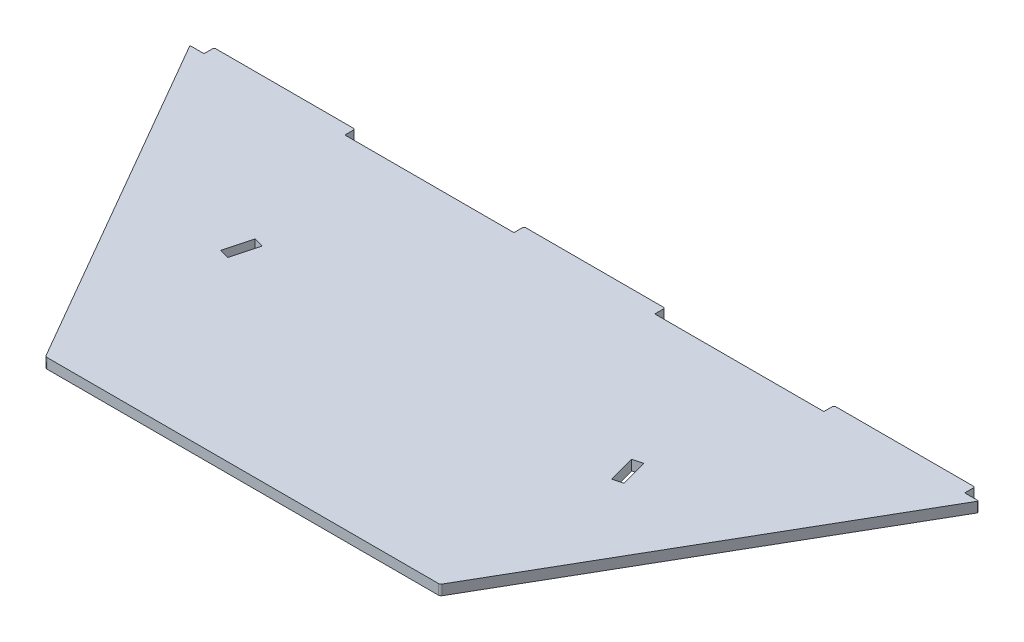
ISO-10303-21;
HEADER;
FILE_DESCRIPTION(('STEP AP214'),'2;1');
FILE_NAME('part.step','',(''),(''),'','','');
FILE_SCHEMA(('AUTOMOTIVE_DESIGN { 1 0 10303 214 1 1 1 1 }'));
ENDSEC;
DATA;
#1=APPLICATION_CONTEXT('core data for automotive mechanical design processes');
#2=APPLICATION_PROTOCOL_DEFINITION('international standard','automotive_design',2000,#1);
#3=PRODUCT_CONTEXT('',#1,'mechanical');
#4=PRODUCT('Part','Part','',(#3));
#5=PRODUCT_RELATED_PRODUCT_CATEGORY('part','',(#4));
#6=PRODUCT_DEFINITION_FORMATION('','',#4);
#7=PRODUCT_DEFINITION_CONTEXT('part definition',#1,'design');
#8=PRODUCT_DEFINITION('design','',#6,#7);
#9=PRODUCT_DEFINITION_SHAPE('','',#8);
#10=(LENGTH_UNIT() NAMED_UNIT(*) SI_UNIT(.MILLI.,.METRE.));
#11=(NAMED_UNIT(*) PLANE_ANGLE_UNIT() SI_UNIT($,.RADIAN.));
#12=(NAMED_UNIT(*) SI_UNIT($,.STERADIAN.) SOLID_ANGLE_UNIT());
#13=UNCERTAINTY_MEASURE_WITH_UNIT(LENGTH_MEASURE(1.E-05),#10,'distance_accuracy_value','');
#14=(GEOMETRIC_REPRESENTATION_CONTEXT(3) GLOBAL_UNCERTAINTY_ASSIGNED_CONTEXT((#13)) GLOBAL_UNIT_ASSIGNED_CONTEXT((#10,
#11,#12)) REPRESENTATION_CONTEXT('',''));
#15=CARTESIAN_POINT('',(0.,0.,0.));
#16=DIRECTION('',(0.,0.,1.));
#17=DIRECTION('',(1.,0.,0.));
#18=AXIS2_PLACEMENT_3D('',#15,#16,#17);
#19=CARTESIAN_POINT('',(-700.,0.,0.));
#20=DIRECTION('',(0.,0.,1.));
#21=DIRECTION('',(1.,0.,0.));
#22=AXIS2_PLACEMENT_3D('',#19,#20,#21);
#23=PLANE('',#22);
#24=DIRECTION('',(1.,0.,0.));
#25=VECTOR('',#24,1.);
#26=CARTESIAN_POINT('',(-700.,18.,0.));
#27=LINE('',#26,#25);
#28=CARTESIAN_POINT('',(125.,18.,0.));
#29=VERTEX_POINT('',#28);
#30=CARTESIAN_POINT('',(425.,18.,0.));
#31=VERTEX_POINT('',#30);
#32=EDGE_CURVE('E529',#29,#31,#27,.T.);
#33=ORIENTED_EDGE('',*,*,#32,.T.);
#34=DIRECTION('',(0.,1.,0.));
#35=VECTOR('',#34,1.);
#36=CARTESIAN_POINT('',(425.,0.,0.));
#37=LINE('',#36,#35);
#38=CARTESIAN_POINT('',(425.,0.,0.));
#39=VERTEX_POINT('',#38);
#40=EDGE_CURVE('E340',#39,#31,#37,.T.);
#41=ORIENTED_EDGE('',*,*,#40,.F.);
#42=DIRECTION('',(1.,0.,0.));
#43=VECTOR('',#42,1.);
#44=CARTESIAN_POINT('',(-700.,0.,0.));
#45=LINE('',#44,#43);
#46=CARTESIAN_POINT('',(125.,0.,0.));
#47=VERTEX_POINT('',#46);
#48=EDGE_CURVE('E642',#47,#39,#45,.T.);
#49=ORIENTED_EDGE('',*,*,#48,.F.);
#50=DIRECTION('',(0.,1.,0.));
#51=VECTOR('',#50,1.);
#52=CARTESIAN_POINT('',(125.,0.,0.));
#53=LINE('',#52,#51);
#54=EDGE_CURVE('E369',#47,#29,#53,.T.);
#55=ORIENTED_EDGE('',*,*,#54,.T.);
#56=EDGE_LOOP('',(#33,#41,#49,#55));
#57=FACE_BOUND('',#56,.T.);
#58=ADVANCED_FACE('F35',(#57),#23,.F.);
#59=CARTESIAN_POINT('',(-425.,18.,0.));
#60=VERTEX_POINT('',#59);
#61=CARTESIAN_POINT('',(-125.,18.,0.));
#62=VERTEX_POINT('',#61);
#63=EDGE_CURVE('E405',#60,#62,#27,.T.);
#64=ORIENTED_EDGE('',*,*,#63,.T.);
#65=DIRECTION('',(0.,1.,0.));
#66=VECTOR('',#65,1.);
#67=CARTESIAN_POINT('',(-125.,0.,0.));
#68=LINE('',#67,#66);
#69=CARTESIAN_POINT('',(-125.,0.,0.));
#70=VERTEX_POINT('',#69);
#71=EDGE_CURVE('E362',#70,#62,#68,.T.);
#72=ORIENTED_EDGE('',*,*,#71,.F.);
#73=CARTESIAN_POINT('',(-425.,0.,0.));
#74=VERTEX_POINT('',#73);
#75=EDGE_CURVE('E400',#74,#70,#45,.T.);
#76=ORIENTED_EDGE('',*,*,#75,.F.);
#77=DIRECTION('',(0.,1.,0.));
#78=VECTOR('',#77,1.);
#79=CARTESIAN_POINT('',(-425.,0.,0.));
#80=LINE('',#79,#78);
#81=EDGE_CURVE('E390',#74,#60,#80,.T.);
#82=ORIENTED_EDGE('',*,*,#81,.T.);
#83=EDGE_LOOP('',(#64,#72,#76,#82));
#84=FACE_BOUND('',#83,.T.);
#85=ADVANCED_FACE('F583',(#84),#23,.F.);
#86=CARTESIAN_POINT('',(-698.,0.,0.));
#87=VERTEX_POINT('',#86);
#88=CARTESIAN_POINT('',(-675.,0.,0.));
#89=VERTEX_POINT('',#88);
#90=EDGE_CURVE('E396',#87,#89,#45,.T.);
#91=ORIENTED_EDGE('',*,*,#90,.F.);
#92=DIRECTION('',(0.,1.,0.));
#93=VECTOR('',#92,1.);
#94=CARTESIAN_POINT('',(-698.,0.,0.));
#95=LINE('',#94,#93);
#96=CARTESIAN_POINT('',(-698.,18.,0.));
#97=VERTEX_POINT('',#96);
#98=EDGE_CURVE('E460',#87,#97,#95,.T.);
#99=ORIENTED_EDGE('',*,*,#98,.T.);
#100=CARTESIAN_POINT('',(-675.,18.,0.));
#101=VERTEX_POINT('',#100);
#102=EDGE_CURVE('E402',#97,#101,#27,.T.);
#103=ORIENTED_EDGE('',*,*,#102,.T.);
#104=DIRECTION('',(0.,1.,0.));
#105=VECTOR('',#104,1.);
#106=CARTESIAN_POINT('',(-675.,0.,0.));
#107=LINE('',#106,#105);
#108=EDGE_CURVE('E384',#89,#101,#107,.T.);
#109=ORIENTED_EDGE('',*,*,#108,.F.);
#110=EDGE_LOOP('',(#91,#99,#103,#109));
#111=FACE_BOUND('',#110,.T.);
#112=ADVANCED_FACE('F573',(#111),#23,.F.);
#113=CARTESIAN_POINT('',(-700.,18.,0.));
#114=DIRECTION('',(0.866025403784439,0.,-0.5));
#115=DIRECTION('',(-0.5,0.,-0.866025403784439));
#116=AXIS2_PLACEMENT_3D('',#113,#114,#115);
#117=PLANE('',#116);
#118=DIRECTION('',(0.5,0.,0.866025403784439));
#119=VECTOR('',#118,1.);
#120=CARTESIAN_POINT('',(-700.,18.,0.));
#121=LINE('',#120,#119);
#122=CARTESIAN_POINT('',(-699.267949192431,18.,1.2679491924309));
#123=VERTEX_POINT('',#122);
#124=CARTESIAN_POINT('',(-351.443375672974,18.,603.717782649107));
#125=VERTEX_POINT('',#124);
#126=EDGE_CURVE('E406',#123,#125,#121,.T.);
#127=ORIENTED_EDGE('',*,*,#126,.F.);
#128=DIRECTION('',(0.,-1.,0.));
#129=VECTOR('',#128,1.);
#130=CARTESIAN_POINT('',(-699.267949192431,18.,1.26794919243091));
#131=LINE('',#130,#129);
#132=CARTESIAN_POINT('',(-699.267949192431,0.,1.2679491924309));
#133=VERTEX_POINT('',#132);
#134=EDGE_CURVE('E441',#123,#133,#131,.T.);
#135=ORIENTED_EDGE('',*,*,#134,.T.);
#136=DIRECTION('',(0.5,0.,0.866025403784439));
#137=VECTOR('',#136,1.);
#138=CARTESIAN_POINT('',(-700.,0.,0.));
#139=LINE('',#138,#137);
#140=CARTESIAN_POINT('',(-351.443375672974,0.,603.717782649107));
#141=VERTEX_POINT('',#140);
#142=EDGE_CURVE('E399',#133,#141,#139,.T.);
#143=ORIENTED_EDGE('',*,*,#142,.T.);
#144=DIRECTION('',(0.,-1.,0.));
#145=VECTOR('',#144,1.);
#146=CARTESIAN_POINT('',(-351.443375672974,18.,603.717782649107));
#147=LINE('',#146,#145);
#148=EDGE_CURVE('E438',#141,#125,#147,.F.);
#149=ORIENTED_EDGE('',*,*,#148,.T.);
#150=EDGE_LOOP('',(#127,#135,#143,#149));
#151=FACE_BOUND('',#150,.T.);
#152=ADVANCED_FACE('F566',(#151),#117,.F.);
#153=CARTESIAN_POINT('',(-350.,18.,606.217782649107));
#154=DIRECTION('',(0.,0.,-1.));
#155=DIRECTION('',(-1.,0.,0.));
#156=AXIS2_PLACEMENT_3D('',#153,#154,#155);
#157=PLANE('',#156);
#158=DIRECTION('',(1.,0.,0.));
#159=VECTOR('',#158,1.);
#160=CARTESIAN_POINT('',(-350.,0.,606.217782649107));
#161=LINE('',#160,#159);
#162=CARTESIAN_POINT('',(-347.113248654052,0.,606.217782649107));
#163=VERTEX_POINT('',#162);
#164=CARTESIAN_POINT('',(347.113248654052,0.,606.217782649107));
#165=VERTEX_POINT('',#164);
#166=EDGE_CURVE('E417',#163,#165,#161,.T.);
#167=ORIENTED_EDGE('',*,*,#166,.T.);
#168=DIRECTION('',(0.,-1.,0.));
#169=VECTOR('',#168,1.);
#170=CARTESIAN_POINT('',(347.113248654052,18.,606.217782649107));
#171=LINE('',#170,#169);
#172=CARTESIAN_POINT('',(347.113248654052,18.,606.217782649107));
#173=VERTEX_POINT('',#172);
#174=EDGE_CURVE('E432',#165,#173,#171,.F.);
#175=ORIENTED_EDGE('',*,*,#174,.T.);
#176=DIRECTION('',(1.,0.,0.));
#177=VECTOR('',#176,1.);
#178=CARTESIAN_POINT('',(-350.,18.,606.217782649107));
#179=LINE('',#178,#177);
#180=CARTESIAN_POINT('',(-347.113248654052,18.,606.217782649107));
#181=VERTEX_POINT('',#180);
#182=EDGE_CURVE('E408',#181,#173,#179,.T.);
#183=ORIENTED_EDGE('',*,*,#182,.F.);
#184=DIRECTION('',(0.,-1.,0.));
#185=VECTOR('',#184,1.);
#186=CARTESIAN_POINT('',(-347.113248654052,18.,606.217782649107));
#187=LINE('',#186,#185);
#188=EDGE_CURVE('E429',#181,#163,#187,.T.);
#189=ORIENTED_EDGE('',*,*,#188,.T.);
#190=EDGE_LOOP('',(#167,#175,#183,#189));
#191=FACE_BOUND('',#190,.T.);
#192=ADVANCED_FACE('F556',(#191),#157,.F.);
#193=CARTESIAN_POINT('',(350.,18.,606.217782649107));
#194=DIRECTION('',(-0.866025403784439,0.,-0.5));
#195=DIRECTION('',(-0.5,0.,0.866025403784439));
#196=AXIS2_PLACEMENT_3D('',#193,#194,#195);
#197=PLANE('',#196);
#198=DIRECTION('',(0.5,0.,-0.866025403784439));
#199=VECTOR('',#198,1.);
#200=CARTESIAN_POINT('',(350.,0.,606.217782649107));
#201=LINE('',#200,#199);
#202=CARTESIAN_POINT('',(351.443375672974,0.,603.717782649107));
#203=VERTEX_POINT('',#202);
#204=CARTESIAN_POINT('',(699.,0.,1.73205080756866));
#205=VERTEX_POINT('',#204);
#206=EDGE_CURVE('E409',#203,#205,#201,.T.);
#207=ORIENTED_EDGE('',*,*,#206,.T.);
#208=DIRECTION('',(0.,1.,0.));
#209=VECTOR('',#208,1.);
#210=CARTESIAN_POINT('',(699.,18.,1.73205080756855));
#211=LINE('',#210,#209);
#212=CARTESIAN_POINT('',(699.,18.,1.73205080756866));
#213=VERTEX_POINT('',#212);
#214=EDGE_CURVE('E480',#205,#213,#211,.T.);
#215=ORIENTED_EDGE('',*,*,#214,.T.);
#216=DIRECTION('',(0.5,0.,-0.866025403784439));
#217=VECTOR('',#216,1.);
#218=CARTESIAN_POINT('',(350.,18.,606.217782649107));
#219=LINE('',#218,#217);
#220=CARTESIAN_POINT('',(351.443375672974,18.,603.717782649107));
#221=VERTEX_POINT('',#220);
#222=EDGE_CURVE('E412',#221,#213,#219,.T.);
#223=ORIENTED_EDGE('',*,*,#222,.F.);
#224=DIRECTION('',(0.,-1.,0.));
#225=VECTOR('',#224,1.);
#226=CARTESIAN_POINT('',(351.443375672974,18.,603.717782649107));
#227=LINE('',#226,#225);
#228=EDGE_CURVE('E415',#221,#203,#227,.T.);
#229=ORIENTED_EDGE('',*,*,#228,.T.);
#230=EDGE_LOOP('',(#207,#215,#223,#229));
#231=FACE_BOUND('',#230,.T.);
#232=ADVANCED_FACE('F547',(#231),#197,.F.);
#233=CARTESIAN_POINT('',(0.,18.,0.));
#234=DIRECTION('',(0.,1.,0.));
#235=DIRECTION('',(0.,0.,1.));
#236=AXIS2_PLACEMENT_3D('',#233,#234,#235);
#237=PLANE('',#236);
#238=DIRECTION('',(0.258819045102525,0.,0.965925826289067));
#239=VECTOR('',#238,1.);
#240=CARTESIAN_POINT('',(358.050053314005,18.,287.466992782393));
#241=LINE('',#240,#239);
#242=CARTESIAN_POINT('',(345.109101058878,18.,239.17070146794));
#243=VERTEX_POINT('',#242);
#244=CARTESIAN_POINT('',(358.050053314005,18.,287.466992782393));
#245=VERTEX_POINT('',#244);
#246=EDGE_CURVE('E259',#243,#245,#241,.T.);
#247=ORIENTED_EDGE('',*,*,#246,.T.);
#248=DIRECTION('',(-0.965925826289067,0.,0.258819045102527));
#249=VECTOR('',#248,1.);
#250=CARTESIAN_POINT('',(340.663388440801,18.,292.125735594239));
#251=LINE('',#250,#249);
#252=CARTESIAN_POINT('',(340.663388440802,18.,292.125735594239));
#253=VERTEX_POINT('',#252);
#254=EDGE_CURVE('E271',#245,#253,#251,.T.);
#255=ORIENTED_EDGE('',*,*,#254,.T.);
#256=DIRECTION('',(-0.258819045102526,0.,-0.965925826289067));
#257=VECTOR('',#256,1.);
#258=CARTESIAN_POINT('',(327.722436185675,18.,243.829444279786));
#259=LINE('',#258,#257);
#260=CARTESIAN_POINT('',(327.722436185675,18.,243.829444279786));
#261=VERTEX_POINT('',#260);
#262=EDGE_CURVE('E275',#253,#261,#259,.T.);
#263=ORIENTED_EDGE('',*,*,#262,.T.);
#264=DIRECTION('',(0.965925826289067,0.,-0.258819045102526));
#265=VECTOR('',#264,1.);
#266=CARTESIAN_POINT('',(345.109101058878,18.,239.17070146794));
#267=LINE('',#266,#265);
#268=EDGE_CURVE('E267',#261,#243,#267,.T.);
#269=ORIENTED_EDGE('',*,*,#268,.T.);
#270=EDGE_LOOP('',(#247,#255,#263,#269));
#271=FACE_BOUND('',#270,.T.);
#272=DIRECTION('',(-0.965925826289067,0.,-0.258819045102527));
#273=VECTOR('',#272,1.);
#274=CARTESIAN_POINT('',(-340.663388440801,18.,292.125735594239));
#275=LINE('',#274,#273);
#276=CARTESIAN_POINT('',(-340.663388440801,18.,292.125735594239));
#277=VERTEX_POINT('',#276);
#278=CARTESIAN_POINT('',(-358.050053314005,18.,287.466992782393));
#279=VERTEX_POINT('',#278);
#280=EDGE_CURVE('E300',#277,#279,#275,.T.);
#281=ORIENTED_EDGE('',*,*,#280,.T.);
#282=DIRECTION('',(0.258819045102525,0.,-0.965925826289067));
#283=VECTOR('',#282,1.);
#284=CARTESIAN_POINT('',(-358.050053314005,18.,287.466992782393));
#285=LINE('',#284,#283);
#286=CARTESIAN_POINT('',(-345.109101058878,18.,239.17070146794));
#287=VERTEX_POINT('',#286);
#288=EDGE_CURVE('E303',#279,#287,#285,.T.);
#289=ORIENTED_EDGE('',*,*,#288,.T.);
#290=DIRECTION('',(0.965925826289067,0.,0.258819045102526));
#291=VECTOR('',#290,1.);
#292=CARTESIAN_POINT('',(-345.109101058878,18.,239.17070146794));
#293=LINE('',#292,#291);
#294=CARTESIAN_POINT('',(-327.722436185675,18.,243.829444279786));
#295=VERTEX_POINT('',#294);
#296=EDGE_CURVE('E307',#287,#295,#293,.T.);
#297=ORIENTED_EDGE('',*,*,#296,.T.);
#298=DIRECTION('',(-0.258819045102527,0.,0.965925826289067));
#299=VECTOR('',#298,1.);
#300=CARTESIAN_POINT('',(-327.722436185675,18.,243.829444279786));
#301=LINE('',#300,#299);
#302=EDGE_CURVE('E310',#295,#277,#301,.T.);
#303=ORIENTED_EDGE('',*,*,#302,.T.);
#304=EDGE_LOOP('',(#281,#289,#297,#303));
#305=FACE_BOUND('',#304,.T.);
#306=ORIENTED_EDGE('',*,*,#102,.F.);
#307=DIRECTION('',(0.70710678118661,0.,-0.707106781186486));
#308=VECTOR('',#307,1.);
#309=CARTESIAN_POINT('',(-348.999999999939,18.,-349.));
#310=LINE('',#309,#308);
#311=EDGE_CURVE('E475',#97,#123,#310,.F.);
#312=ORIENTED_EDGE('',*,*,#311,.T.);
#313=ORIENTED_EDGE('',*,*,#126,.T.);
#314=CARTESIAN_POINT('',(-347.113248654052,18.,601.217782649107));
#315=DIRECTION('',(0.,1.,0.));
#316=DIRECTION('',(0.,0.,1.));
#317=AXIS2_PLACEMENT_3D('',#314,#315,#316);
#318=CIRCLE('',#317,5.);
#319=EDGE_CURVE('E434',#125,#181,#318,.T.);
#320=ORIENTED_EDGE('',*,*,#319,.T.);
#321=ORIENTED_EDGE('',*,*,#182,.T.);
#322=CARTESIAN_POINT('',(347.113248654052,18.,601.217782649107));
#323=DIRECTION('',(0.,1.,0.));
#324=DIRECTION('',(0.,0.,1.));
#325=AXIS2_PLACEMENT_3D('',#322,#323,#324);
#326=CIRCLE('',#325,5.);
#327=EDGE_CURVE('E436',#173,#221,#326,.T.);
#328=ORIENTED_EDGE('',*,*,#327,.T.);
#329=ORIENTED_EDGE('',*,*,#222,.T.);
#330=DIRECTION('',(0.258819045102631,0.,0.965925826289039));
#331=VECTOR('',#330,1.);
#332=CARTESIAN_POINT('',(651.742865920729,18.,-174.633974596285));
#333=LINE('',#332,#331);
#334=CARTESIAN_POINT('',(698.535898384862,18.,0.));
#335=VERTEX_POINT('',#334);
#336=EDGE_CURVE('E473',#213,#335,#333,.F.);
#337=ORIENTED_EDGE('',*,*,#336,.T.);
#338=CARTESIAN_POINT('',(675.,18.,0.));
#339=VERTEX_POINT('',#338);
#340=EDGE_CURVE('E393',#339,#335,#27,.T.);
#341=ORIENTED_EDGE('',*,*,#340,.F.);
#342=DIRECTION('',(0.,0.,-1.));
#343=VECTOR('',#342,1.);
#344=CARTESIAN_POINT('',(675.,18.,0.));
#345=LINE('',#344,#343);
#346=CARTESIAN_POINT('',(675.,18.,-16.0000000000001));
#347=VERTEX_POINT('',#346);
#348=EDGE_CURVE('E342',#339,#347,#345,.T.);
#349=ORIENTED_EDGE('',*,*,#348,.T.);
#350=DIRECTION('',(0.707106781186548,0.,0.707106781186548));
#351=VECTOR('',#350,1.);
#352=CARTESIAN_POINT('',(345.5,18.,-345.5));
#353=LINE('',#352,#351);
#354=CARTESIAN_POINT('',(673.,18.,-18.0000000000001));
#355=VERTEX_POINT('',#354);
#356=EDGE_CURVE('E471',#347,#355,#353,.F.);
#357=ORIENTED_EDGE('',*,*,#356,.T.);
#358=DIRECTION('',(-1.,0.,0.));
#359=VECTOR('',#358,1.);
#360=CARTESIAN_POINT('',(425.,18.,-18.0000000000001));
#361=LINE('',#360,#359);
#362=CARTESIAN_POINT('',(427.,18.,-18.0000000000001));
#363=VERTEX_POINT('',#362);
#364=EDGE_CURVE('E334',#355,#363,#361,.T.);
#365=ORIENTED_EDGE('',*,*,#364,.T.);
#366=DIRECTION('',(0.707106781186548,0.,-0.707106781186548));
#367=VECTOR('',#366,1.);
#368=CARTESIAN_POINT('',(204.5,18.,204.5));
#369=LINE('',#368,#367);
#370=CARTESIAN_POINT('',(425.,18.,-16.0000000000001));
#371=VERTEX_POINT('',#370);
#372=EDGE_CURVE('E469',#363,#371,#369,.F.);
#373=ORIENTED_EDGE('',*,*,#372,.T.);
#374=DIRECTION('',(0.,0.,1.));
#375=VECTOR('',#374,1.);
#376=CARTESIAN_POINT('',(425.,18.,0.));
#377=LINE('',#376,#375);
#378=EDGE_CURVE('E296',#371,#31,#377,.T.);
#379=ORIENTED_EDGE('',*,*,#378,.T.);
#380=ORIENTED_EDGE('',*,*,#32,.F.);
#381=DIRECTION('',(0.,0.,-1.));
#382=VECTOR('',#381,1.);
#383=CARTESIAN_POINT('',(125.,18.,0.));
#384=LINE('',#383,#382);
#385=CARTESIAN_POINT('',(125.,18.,-16.0000000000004));
#386=VERTEX_POINT('',#385);
#387=EDGE_CURVE('E364',#29,#386,#384,.T.);
#388=ORIENTED_EDGE('',*,*,#387,.T.);
#389=DIRECTION('',(0.707106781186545,0.,0.70710678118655));
#390=VECTOR('',#389,1.);
#391=CARTESIAN_POINT('',(70.5000000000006,18.,-70.5000000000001));
#392=LINE('',#391,#390);
#393=CARTESIAN_POINT('',(123.,18.,-18.0000000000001));
#394=VERTEX_POINT('',#393);
#395=EDGE_CURVE('E465',#386,#394,#392,.F.);
#396=ORIENTED_EDGE('',*,*,#395,.T.);
#397=DIRECTION('',(-1.,0.,0.));
#398=VECTOR('',#397,1.);
#399=CARTESIAN_POINT('',(-125.,18.,-18.0000000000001));
#400=LINE('',#399,#398);
#401=CARTESIAN_POINT('',(-123.,18.,-18.0000000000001));
#402=VERTEX_POINT('',#401);
#403=EDGE_CURVE('E356',#394,#402,#400,.T.);
#404=ORIENTED_EDGE('',*,*,#403,.T.);
#405=DIRECTION('',(0.707106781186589,0.,-0.707106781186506));
#406=VECTOR('',#405,1.);
#407=CARTESIAN_POINT('',(-70.4999999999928,18.,-70.5000000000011));
#408=LINE('',#407,#406);
#409=CARTESIAN_POINT('',(-125.,18.,-16.0000000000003));
#410=VERTEX_POINT('',#409);
#411=EDGE_CURVE('E467',#402,#410,#408,.F.);
#412=ORIENTED_EDGE('',*,*,#411,.T.);
#413=DIRECTION('',(0.,0.,1.));
#414=VECTOR('',#413,1.);
#415=CARTESIAN_POINT('',(-125.,18.,0.));
#416=LINE('',#415,#414);
#417=EDGE_CURVE('E350',#410,#62,#416,.T.);
#418=ORIENTED_EDGE('',*,*,#417,.T.);
#419=ORIENTED_EDGE('',*,*,#63,.F.);
#420=DIRECTION('',(0.,0.,-1.));
#421=VECTOR('',#420,1.);
#422=CARTESIAN_POINT('',(-425.,18.,0.));
#423=LINE('',#422,#421);
#424=CARTESIAN_POINT('',(-425.,18.,-16.0000000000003));
#425=VERTEX_POINT('',#424);
#426=EDGE_CURVE('E386',#60,#425,#423,.T.);
#427=ORIENTED_EDGE('',*,*,#426,.T.);
#428=DIRECTION('',(0.707106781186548,0.,0.707106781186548));
#429=VECTOR('',#428,1.);
#430=CARTESIAN_POINT('',(-204.5,18.,204.5));
#431=LINE('',#430,#429);
#432=CARTESIAN_POINT('',(-427.,18.,-18.0000000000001));
#433=VERTEX_POINT('',#432);
#434=EDGE_CURVE('E463',#425,#433,#431,.F.);
#435=ORIENTED_EDGE('',*,*,#434,.T.);
#436=DIRECTION('',(-1.,0.,0.));
#437=VECTOR('',#436,1.);
#438=CARTESIAN_POINT('',(-675.,18.,-18.0000000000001));
#439=LINE('',#438,#437);
#440=CARTESIAN_POINT('',(-673.,18.,-18.0000000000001));
#441=VERTEX_POINT('',#440);
#442=EDGE_CURVE('E378',#433,#441,#439,.T.);
#443=ORIENTED_EDGE('',*,*,#442,.T.);
#444=DIRECTION('',(0.707106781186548,0.,-0.707106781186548));
#445=VECTOR('',#444,1.);
#446=CARTESIAN_POINT('',(-345.5,18.,-345.5));
#447=LINE('',#446,#445);
#448=CARTESIAN_POINT('',(-675.,18.,-16.0000000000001));
#449=VERTEX_POINT('',#448);
#450=EDGE_CURVE('E50',#441,#449,#447,.F.);
#451=ORIENTED_EDGE('',*,*,#450,.T.);
#452=DIRECTION('',(0.,0.,1.));
#453=VECTOR('',#452,1.);
#454=CARTESIAN_POINT('',(-675.,18.,0.));
#455=LINE('',#454,#453);
#456=EDGE_CURVE('E372',#449,#101,#455,.T.);
#457=ORIENTED_EDGE('',*,*,#456,.T.);
#458=EDGE_LOOP('',(#306,#312,#313,#320,#321,#328,#329,#337,#341,#349,#357,#365,#373,#379,#380,
#388,#396,#404,#412,#418,#419,#427,#435,#443,#451,#457));
#459=FACE_BOUND('',#458,.T.);
#460=ADVANCED_FACE('F277',(#271,#305,#459),#237,.T.);
#461=CARTESIAN_POINT('',(0.,0.,0.));
#462=DIRECTION('',(0.,1.,0.));
#463=DIRECTION('',(0.,0.,1.));
#464=AXIS2_PLACEMENT_3D('',#461,#462,#463);
#465=PLANE('',#464);
#466=DIRECTION('',(-0.965925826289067,0.,0.258819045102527));
#467=VECTOR('',#466,1.);
#468=CARTESIAN_POINT('',(340.663388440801,0.,292.125735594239));
#469=LINE('',#468,#467);
#470=CARTESIAN_POINT('',(358.050053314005,0.,287.466992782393));
#471=VERTEX_POINT('',#470);
#472=CARTESIAN_POINT('',(340.663388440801,0.,292.125735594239));
#473=VERTEX_POINT('',#472);
#474=EDGE_CURVE('E289',#471,#473,#469,.T.);
#475=ORIENTED_EDGE('',*,*,#474,.F.);
#476=DIRECTION('',(0.258819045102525,0.,0.965925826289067));
#477=VECTOR('',#476,1.);
#478=CARTESIAN_POINT('',(358.050053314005,0.,287.466992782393));
#479=LINE('',#478,#477);
#480=CARTESIAN_POINT('',(345.109101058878,0.,239.17070146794));
#481=VERTEX_POINT('',#480);
#482=EDGE_CURVE('E262',#481,#471,#479,.T.);
#483=ORIENTED_EDGE('',*,*,#482,.F.);
#484=DIRECTION('',(0.965925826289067,0.,-0.258819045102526));
#485=VECTOR('',#484,1.);
#486=CARTESIAN_POINT('',(345.109101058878,0.,239.17070146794));
#487=LINE('',#486,#485);
#488=CARTESIAN_POINT('',(327.722436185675,0.,243.829444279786));
#489=VERTEX_POINT('',#488);
#490=EDGE_CURVE('E280',#489,#481,#487,.T.);
#491=ORIENTED_EDGE('',*,*,#490,.F.);
#492=DIRECTION('',(-0.258819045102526,0.,-0.965925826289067));
#493=VECTOR('',#492,1.);
#494=CARTESIAN_POINT('',(327.722436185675,0.,243.829444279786));
#495=LINE('',#494,#493);
#496=EDGE_CURVE('E283',#473,#489,#495,.T.);
#497=ORIENTED_EDGE('',*,*,#496,.F.);
#498=EDGE_LOOP('',(#475,#483,#491,#497));
#499=FACE_BOUND('',#498,.T.);
#500=DIRECTION('',(0.258819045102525,0.,-0.965925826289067));
#501=VECTOR('',#500,1.);
#502=CARTESIAN_POINT('',(-358.050053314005,0.,287.466992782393));
#503=LINE('',#502,#501);
#504=CARTESIAN_POINT('',(-358.050053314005,0.,287.466992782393));
#505=VERTEX_POINT('',#504);
#506=CARTESIAN_POINT('',(-345.109101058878,0.,239.17070146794));
#507=VERTEX_POINT('',#506);
#508=EDGE_CURVE('E316',#505,#507,#503,.T.);
#509=ORIENTED_EDGE('',*,*,#508,.F.);
#510=DIRECTION('',(-0.965925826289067,0.,-0.258819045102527));
#511=VECTOR('',#510,1.);
#512=CARTESIAN_POINT('',(-340.663388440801,0.,292.125735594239));
#513=LINE('',#512,#511);
#514=CARTESIAN_POINT('',(-340.663388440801,0.,292.125735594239));
#515=VERTEX_POINT('',#514);
#516=EDGE_CURVE('E314',#515,#505,#513,.T.);
#517=ORIENTED_EDGE('',*,*,#516,.F.);
#518=DIRECTION('',(-0.258819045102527,0.,0.965925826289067));
#519=VECTOR('',#518,1.);
#520=CARTESIAN_POINT('',(-327.722436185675,0.,243.829444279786));
#521=LINE('',#520,#519);
#522=CARTESIAN_POINT('',(-327.722436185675,0.,243.829444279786));
#523=VERTEX_POINT('',#522);
#524=EDGE_CURVE('E304',#523,#515,#521,.T.);
#525=ORIENTED_EDGE('',*,*,#524,.F.);
#526=DIRECTION('',(0.965925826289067,0.,0.258819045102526));
#527=VECTOR('',#526,1.);
#528=CARTESIAN_POINT('',(-345.109101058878,0.,239.17070146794));
#529=LINE('',#528,#527);
#530=EDGE_CURVE('E319',#507,#523,#529,.T.);
#531=ORIENTED_EDGE('',*,*,#530,.F.);
#532=EDGE_LOOP('',(#509,#517,#525,#531));
#533=FACE_BOUND('',#532,.T.);
#534=ORIENTED_EDGE('',*,*,#142,.F.);
#535=DIRECTION('',(-0.70710678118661,0.,0.707106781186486));
#536=VECTOR('',#535,1.);
#537=CARTESIAN_POINT('',(-699.267949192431,0.,1.26794919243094));
#538=LINE('',#537,#536);
#539=EDGE_CURVE('E458',#133,#87,#538,.F.);
#540=ORIENTED_EDGE('',*,*,#539,.T.);
#541=ORIENTED_EDGE('',*,*,#90,.T.);
#542=DIRECTION('',(0.,0.,1.));
#543=VECTOR('',#542,1.);
#544=CARTESIAN_POINT('',(-675.,0.,0.));
#545=LINE('',#544,#543);
#546=CARTESIAN_POINT('',(-675.,0.,-16.0000000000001));
#547=VERTEX_POINT('',#546);
#548=EDGE_CURVE('E375',#547,#89,#545,.T.);
#549=ORIENTED_EDGE('',*,*,#548,.F.);
#550=DIRECTION('',(-0.707106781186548,0.,0.707106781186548));
#551=VECTOR('',#550,1.);
#552=CARTESIAN_POINT('',(-673.,0.,-18.0000000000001));
#553=LINE('',#552,#551);
#554=CARTESIAN_POINT('',(-673.,0.,-18.0000000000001));
#555=VERTEX_POINT('',#554);
#556=EDGE_CURVE('E444',#547,#555,#553,.F.);
#557=ORIENTED_EDGE('',*,*,#556,.T.);
#558=DIRECTION('',(-1.,0.,0.));
#559=VECTOR('',#558,1.);
#560=CARTESIAN_POINT('',(-675.,0.,-18.0000000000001));
#561=LINE('',#560,#559);
#562=CARTESIAN_POINT('',(-427.,0.,-18.0000000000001));
#563=VERTEX_POINT('',#562);
#564=EDGE_CURVE('E381',#563,#555,#561,.T.);
#565=ORIENTED_EDGE('',*,*,#564,.F.);
#566=DIRECTION('',(-0.707106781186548,0.,-0.707106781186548));
#567=VECTOR('',#566,1.);
#568=CARTESIAN_POINT('',(-425.,0.,-16.0000000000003));
#569=LINE('',#568,#567);
#570=CARTESIAN_POINT('',(-425.,0.,-16.0000000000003));
#571=VERTEX_POINT('',#570);
#572=EDGE_CURVE('E446',#563,#571,#569,.F.);
#573=ORIENTED_EDGE('',*,*,#572,.T.);
#574=DIRECTION('',(0.,0.,-1.));
#575=VECTOR('',#574,1.);
#576=CARTESIAN_POINT('',(-425.,0.,0.));
#577=LINE('',#576,#575);
#578=EDGE_CURVE('E377',#74,#571,#577,.T.);
#579=ORIENTED_EDGE('',*,*,#578,.F.);
#580=ORIENTED_EDGE('',*,*,#75,.T.);
#581=DIRECTION('',(0.,0.,1.));
#582=VECTOR('',#581,1.);
#583=CARTESIAN_POINT('',(-125.,0.,0.));
#584=LINE('',#583,#582);
#585=CARTESIAN_POINT('',(-125.,0.,-16.0000000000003));
#586=VERTEX_POINT('',#585);
#587=EDGE_CURVE('E353',#586,#70,#584,.T.);
#588=ORIENTED_EDGE('',*,*,#587,.F.);
#589=DIRECTION('',(-0.707106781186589,0.,0.707106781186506));
#590=VECTOR('',#589,1.);
#591=CARTESIAN_POINT('',(-123.,0.,-18.0000000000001));
#592=LINE('',#591,#590);
#593=CARTESIAN_POINT('',(-123.,0.,-18.0000000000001));
#594=VERTEX_POINT('',#593);
#595=EDGE_CURVE('E450',#586,#594,#592,.F.);
#596=ORIENTED_EDGE('',*,*,#595,.T.);
#597=DIRECTION('',(-1.,0.,0.));
#598=VECTOR('',#597,1.);
#599=CARTESIAN_POINT('',(-125.,0.,-18.0000000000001));
#600=LINE('',#599,#598);
#601=CARTESIAN_POINT('',(123.,0.,-18.0000000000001));
#602=VERTEX_POINT('',#601);
#603=EDGE_CURVE('E359',#602,#594,#600,.T.);
#604=ORIENTED_EDGE('',*,*,#603,.F.);
#605=DIRECTION('',(-0.707106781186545,0.,-0.70710678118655));
#606=VECTOR('',#605,1.);
#607=CARTESIAN_POINT('',(125.,0.,-16.0000000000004));
#608=LINE('',#607,#606);
#609=CARTESIAN_POINT('',(125.,0.,-16.0000000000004));
#610=VERTEX_POINT('',#609);
#611=EDGE_CURVE('E448',#602,#610,#608,.F.);
#612=ORIENTED_EDGE('',*,*,#611,.T.);
#613=DIRECTION('',(0.,0.,-1.));
#614=VECTOR('',#613,1.);
#615=CARTESIAN_POINT('',(125.,0.,0.));
#616=LINE('',#615,#614);
#617=EDGE_CURVE('E355',#47,#610,#616,.T.);
#618=ORIENTED_EDGE('',*,*,#617,.F.);
#619=ORIENTED_EDGE('',*,*,#48,.T.);
#620=DIRECTION('',(0.,0.,1.));
#621=VECTOR('',#620,1.);
#622=CARTESIAN_POINT('',(425.,0.,0.));
#623=LINE('',#622,#621);
#624=CARTESIAN_POINT('',(425.,0.,-16.0000000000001));
#625=VERTEX_POINT('',#624);
#626=EDGE_CURVE('E331',#625,#39,#623,.T.);
#627=ORIENTED_EDGE('',*,*,#626,.F.);
#628=DIRECTION('',(-0.707106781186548,0.,0.707106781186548));
#629=VECTOR('',#628,1.);
#630=CARTESIAN_POINT('',(427.,0.,-18.0000000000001));
#631=LINE('',#630,#629);
#632=CARTESIAN_POINT('',(427.,0.,-18.0000000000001));
#633=VERTEX_POINT('',#632);
#634=EDGE_CURVE('E452',#625,#633,#631,.F.);
#635=ORIENTED_EDGE('',*,*,#634,.T.);
#636=DIRECTION('',(-1.,0.,0.));
#637=VECTOR('',#636,1.);
#638=CARTESIAN_POINT('',(425.,0.,-18.0000000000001));
#639=LINE('',#638,#637);
#640=CARTESIAN_POINT('',(673.,0.,-18.0000000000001));
#641=VERTEX_POINT('',#640);
#642=EDGE_CURVE('E337',#641,#633,#639,.T.);
#643=ORIENTED_EDGE('',*,*,#642,.F.);
#644=DIRECTION('',(-0.707106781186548,0.,-0.707106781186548));
#645=VECTOR('',#644,1.);
#646=CARTESIAN_POINT('',(675.,0.,-16.0000000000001));
#647=LINE('',#646,#645);
#648=CARTESIAN_POINT('',(675.,0.,-16.0000000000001));
#649=VERTEX_POINT('',#648);
#650=EDGE_CURVE('E454',#641,#649,#647,.F.);
#651=ORIENTED_EDGE('',*,*,#650,.T.);
#652=DIRECTION('',(0.,0.,-1.));
#653=VECTOR('',#652,1.);
#654=CARTESIAN_POINT('',(675.,0.,0.));
#655=LINE('',#654,#653);
#656=CARTESIAN_POINT('',(675.,0.,0.));
#657=VERTEX_POINT('',#656);
#658=EDGE_CURVE('E333',#657,#649,#655,.T.);
#659=ORIENTED_EDGE('',*,*,#658,.F.);
#660=CARTESIAN_POINT('',(698.535898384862,0.,0.));
#661=VERTEX_POINT('',#660);
#662=EDGE_CURVE('E401',#657,#661,#45,.T.);
#663=ORIENTED_EDGE('',*,*,#662,.T.);
#664=DIRECTION('',(-0.258819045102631,0.,-0.965925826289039));
#665=VECTOR('',#664,1.);
#666=CARTESIAN_POINT('',(698.535898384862,0.,0.));
#667=LINE('',#666,#665);
#668=EDGE_CURVE('E456',#661,#205,#667,.F.);
#669=ORIENTED_EDGE('',*,*,#668,.T.);
#670=ORIENTED_EDGE('',*,*,#206,.F.);
#671=CARTESIAN_POINT('',(347.113248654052,0.,601.217782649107));
#672=DIRECTION('',(0.,1.,0.));
#673=DIRECTION('',(0.,0.,1.));
#674=AXIS2_PLACEMENT_3D('',#671,#672,#673);
#675=CIRCLE('',#674,5.);
#676=EDGE_CURVE('E427',#203,#165,#675,.F.);
#677=ORIENTED_EDGE('',*,*,#676,.T.);
#678=ORIENTED_EDGE('',*,*,#166,.F.);
#679=CARTESIAN_POINT('',(-347.113248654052,0.,601.217782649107));
#680=DIRECTION('',(0.,1.,0.));
#681=DIRECTION('',(0.,0.,1.));
#682=AXIS2_PLACEMENT_3D('',#679,#680,#681);
#683=CIRCLE('',#682,5.);
#684=EDGE_CURVE('E424',#163,#141,#683,.F.);
#685=ORIENTED_EDGE('',*,*,#684,.T.);
#686=EDGE_LOOP('',(#534,#540,#541,#549,#557,#565,#573,#579,#580,#588,#596,#604,#612,#618,#619,
#627,#635,#643,#651,#659,#663,#669,#670,#677,#678,#685));
#687=FACE_BOUND('',#686,.T.);
#688=ADVANCED_FACE('F515',(#499,#533,#687),#465,.F.);
#689=ORIENTED_EDGE('',*,*,#340,.T.);
#690=DIRECTION('',(0.,-1.,0.));
#691=VECTOR('',#690,1.);
#692=CARTESIAN_POINT('',(698.535898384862,0.,0.));
#693=LINE('',#692,#691);
#694=EDGE_CURVE('E477',#335,#661,#693,.T.);
#695=ORIENTED_EDGE('',*,*,#694,.T.);
#696=ORIENTED_EDGE('',*,*,#662,.F.);
#697=DIRECTION('',(0.,1.,0.));
#698=VECTOR('',#697,1.);
#699=CARTESIAN_POINT('',(675.,0.,0.));
#700=LINE('',#699,#698);
#701=EDGE_CURVE('E347',#657,#339,#700,.T.);
#702=ORIENTED_EDGE('',*,*,#701,.T.);
#703=EDGE_LOOP('',(#689,#695,#696,#702));
#704=FACE_BOUND('',#703,.T.);
#705=ADVANCED_FACE('F536',(#704),#23,.F.);
#706=CARTESIAN_POINT('',(-675.,0.,0.));
#707=DIRECTION('',(-1.,0.,0.));
#708=DIRECTION('',(0.,0.,1.));
#709=AXIS2_PLACEMENT_3D('',#706,#707,#708);
#710=PLANE('',#709);
#711=ORIENTED_EDGE('',*,*,#456,.F.);
#712=DIRECTION('',(0.,-1.,0.));
#713=VECTOR('',#712,1.);
#714=CARTESIAN_POINT('',(-675.,0.,-16.0000000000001));
#715=LINE('',#714,#713);
#716=EDGE_CURVE('E11',#449,#547,#715,.T.);
#717=ORIENTED_EDGE('',*,*,#716,.T.);
#718=ORIENTED_EDGE('',*,*,#548,.T.);
#719=ORIENTED_EDGE('',*,*,#108,.T.);
#720=EDGE_LOOP('',(#711,#717,#718,#719));
#721=FACE_BOUND('',#720,.T.);
#722=ADVANCED_FACE('F576',(#721),#710,.T.);
#723=CARTESIAN_POINT('',(-675.,0.,-18.0000000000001));
#724=DIRECTION('',(0.,0.,-1.));
#725=DIRECTION('',(-1.,0.,0.));
#726=AXIS2_PLACEMENT_3D('',#723,#724,#725);
#727=PLANE('',#726);
#728=ORIENTED_EDGE('',*,*,#442,.F.);
#729=DIRECTION('',(0.,-1.,0.));
#730=VECTOR('',#729,1.);
#731=CARTESIAN_POINT('',(-427.,0.,-18.0000000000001));
#732=LINE('',#731,#730);
#733=EDGE_CURVE('E43',#433,#563,#732,.T.);
#734=ORIENTED_EDGE('',*,*,#733,.T.);
#735=ORIENTED_EDGE('',*,*,#564,.T.);
#736=DIRECTION('',(0.,1.,0.));
#737=VECTOR('',#736,1.);
#738=CARTESIAN_POINT('',(-673.,0.,-18.0000000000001));
#739=LINE('',#738,#737);
#740=EDGE_CURVE('E505',#555,#441,#739,.T.);
#741=ORIENTED_EDGE('',*,*,#740,.T.);
#742=EDGE_LOOP('',(#728,#734,#735,#741));
#743=FACE_BOUND('',#742,.T.);
#744=ADVANCED_FACE('F510',(#743),#727,.T.);
#745=CARTESIAN_POINT('',(-425.,0.,0.));
#746=DIRECTION('',(1.,0.,0.));
#747=DIRECTION('',(0.,0.,-1.));
#748=AXIS2_PLACEMENT_3D('',#745,#746,#747);
#749=PLANE('',#748);
#750=ORIENTED_EDGE('',*,*,#578,.T.);
#751=DIRECTION('',(0.,1.,0.));
#752=VECTOR('',#751,1.);
#753=CARTESIAN_POINT('',(-425.,0.,-16.0000000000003));
#754=LINE('',#753,#752);
#755=EDGE_CURVE('E502',#571,#425,#754,.T.);
#756=ORIENTED_EDGE('',*,*,#755,.T.);
#757=ORIENTED_EDGE('',*,*,#426,.F.);
#758=ORIENTED_EDGE('',*,*,#81,.F.);
#759=EDGE_LOOP('',(#750,#756,#757,#758));
#760=FACE_BOUND('',#759,.T.);
#761=ADVANCED_FACE('F522',(#760),#749,.T.);
#762=CARTESIAN_POINT('',(-125.,0.,0.));
#763=DIRECTION('',(-1.,0.,0.));
#764=DIRECTION('',(0.,0.,1.));
#765=AXIS2_PLACEMENT_3D('',#762,#763,#764);
#766=PLANE('',#765);
#767=ORIENTED_EDGE('',*,*,#417,.F.);
#768=DIRECTION('',(0.,-1.,0.));
#769=VECTOR('',#768,1.);
#770=CARTESIAN_POINT('',(-125.,0.,-16.0000000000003));
#771=LINE('',#770,#769);
#772=EDGE_CURVE('E497',#410,#586,#771,.T.);
#773=ORIENTED_EDGE('',*,*,#772,.T.);
#774=ORIENTED_EDGE('',*,*,#587,.T.);
#775=ORIENTED_EDGE('',*,*,#71,.T.);
#776=EDGE_LOOP('',(#767,#773,#774,#775));
#777=FACE_BOUND('',#776,.T.);
#778=ADVANCED_FACE('F649',(#777),#766,.T.);
#779=CARTESIAN_POINT('',(-125.,0.,-18.0000000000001));
#780=DIRECTION('',(0.,0.,-1.));
#781=DIRECTION('',(-1.,0.,0.));
#782=AXIS2_PLACEMENT_3D('',#779,#780,#781);
#783=PLANE('',#782);
#784=ORIENTED_EDGE('',*,*,#603,.T.);
#785=DIRECTION('',(0.,1.,0.));
#786=VECTOR('',#785,1.);
#787=CARTESIAN_POINT('',(-123.,0.,-18.0000000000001));
#788=LINE('',#787,#786);
#789=EDGE_CURVE('E494',#594,#402,#788,.T.);
#790=ORIENTED_EDGE('',*,*,#789,.T.);
#791=ORIENTED_EDGE('',*,*,#403,.F.);
#792=DIRECTION('',(0.,-1.,0.));
#793=VECTOR('',#792,1.);
#794=CARTESIAN_POINT('',(123.,0.,-18.0000000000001));
#795=LINE('',#794,#793);
#796=EDGE_CURVE('E492',#394,#602,#795,.T.);
#797=ORIENTED_EDGE('',*,*,#796,.T.);
#798=EDGE_LOOP('',(#784,#790,#791,#797));
#799=FACE_BOUND('',#798,.T.);
#800=ADVANCED_FACE('F653',(#799),#783,.T.);
#801=CARTESIAN_POINT('',(125.,0.,0.));
#802=DIRECTION('',(1.,0.,0.));
#803=DIRECTION('',(0.,0.,-1.));
#804=AXIS2_PLACEMENT_3D('',#801,#802,#803);
#805=PLANE('',#804);
#806=ORIENTED_EDGE('',*,*,#617,.T.);
#807=DIRECTION('',(0.,1.,0.));
#808=VECTOR('',#807,1.);
#809=CARTESIAN_POINT('',(125.,0.,-16.0000000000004));
#810=LINE('',#809,#808);
#811=EDGE_CURVE('E499',#610,#386,#810,.T.);
#812=ORIENTED_EDGE('',*,*,#811,.T.);
#813=ORIENTED_EDGE('',*,*,#387,.F.);
#814=ORIENTED_EDGE('',*,*,#54,.F.);
#815=EDGE_LOOP('',(#806,#812,#813,#814));
#816=FACE_BOUND('',#815,.T.);
#817=ADVANCED_FACE('F640',(#816),#805,.T.);
#818=CARTESIAN_POINT('',(425.,0.,0.));
#819=DIRECTION('',(-1.,0.,0.));
#820=DIRECTION('',(0.,0.,1.));
#821=AXIS2_PLACEMENT_3D('',#818,#819,#820);
#822=PLANE('',#821);
#823=ORIENTED_EDGE('',*,*,#378,.F.);
#824=DIRECTION('',(0.,-1.,0.));
#825=VECTOR('',#824,1.);
#826=CARTESIAN_POINT('',(425.,0.,-16.0000000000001));
#827=LINE('',#826,#825);
#828=EDGE_CURVE('E490',#371,#625,#827,.T.);
#829=ORIENTED_EDGE('',*,*,#828,.T.);
#830=ORIENTED_EDGE('',*,*,#626,.T.);
#831=ORIENTED_EDGE('',*,*,#40,.T.);
#832=EDGE_LOOP('',(#823,#829,#830,#831));
#833=FACE_BOUND('',#832,.T.);
#834=ADVANCED_FACE('F658',(#833),#822,.T.);
#835=CARTESIAN_POINT('',(425.,0.,-18.0000000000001));
#836=DIRECTION('',(0.,0.,-1.));
#837=DIRECTION('',(-1.,0.,0.));
#838=AXIS2_PLACEMENT_3D('',#835,#836,#837);
#839=PLANE('',#838);
#840=ORIENTED_EDGE('',*,*,#364,.F.);
#841=DIRECTION('',(0.,-1.,0.));
#842=VECTOR('',#841,1.);
#843=CARTESIAN_POINT('',(673.,0.,-18.0000000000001));
#844=LINE('',#843,#842);
#845=EDGE_CURVE('E488',#355,#641,#844,.T.);
#846=ORIENTED_EDGE('',*,*,#845,.T.);
#847=ORIENTED_EDGE('',*,*,#642,.T.);
#848=DIRECTION('',(0.,1.,0.));
#849=VECTOR('',#848,1.);
#850=CARTESIAN_POINT('',(427.,0.,-18.0000000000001));
#851=LINE('',#850,#849);
#852=EDGE_CURVE('E485',#633,#363,#851,.T.);
#853=ORIENTED_EDGE('',*,*,#852,.T.);
#854=EDGE_LOOP('',(#840,#846,#847,#853));
#855=FACE_BOUND('',#854,.T.);
#856=ADVANCED_FACE('F665',(#855),#839,.T.);
#857=CARTESIAN_POINT('',(675.,0.,0.));
#858=DIRECTION('',(1.,0.,0.));
#859=DIRECTION('',(0.,0.,-1.));
#860=AXIS2_PLACEMENT_3D('',#857,#858,#859);
#861=PLANE('',#860);
#862=ORIENTED_EDGE('',*,*,#658,.T.);
#863=DIRECTION('',(0.,1.,0.));
#864=VECTOR('',#863,1.);
#865=CARTESIAN_POINT('',(675.,0.,-16.0000000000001));
#866=LINE('',#865,#864);
#867=EDGE_CURVE('E482',#649,#347,#866,.T.);
#868=ORIENTED_EDGE('',*,*,#867,.T.);
#869=ORIENTED_EDGE('',*,*,#348,.F.);
#870=ORIENTED_EDGE('',*,*,#701,.F.);
#871=EDGE_LOOP('',(#862,#868,#869,#870));
#872=FACE_BOUND('',#871,.T.);
#873=ADVANCED_FACE('F669',(#872),#861,.T.);
#874=CARTESIAN_POINT('',(-340.663388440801,18.,292.125735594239));
#875=DIRECTION('',(-0.258819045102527,0.,0.965925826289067));
#876=DIRECTION('',(0.965925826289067,0.,0.258819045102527));
#877=AXIS2_PLACEMENT_3D('',#874,#875,#876);
#878=PLANE('',#877);
#879=ORIENTED_EDGE('',*,*,#516,.T.);
#880=DIRECTION('',(0.,-1.,0.));
#881=VECTOR('',#880,1.);
#882=CARTESIAN_POINT('',(-358.050053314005,18.,287.466992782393));
#883=LINE('',#882,#881);
#884=EDGE_CURVE('E313',#279,#505,#883,.T.);
#885=ORIENTED_EDGE('',*,*,#884,.F.);
#886=ORIENTED_EDGE('',*,*,#280,.F.);
#887=DIRECTION('',(0.,-1.,0.));
#888=VECTOR('',#887,1.);
#889=CARTESIAN_POINT('',(-340.663388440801,18.,292.125735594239));
#890=LINE('',#889,#888);
#891=EDGE_CURVE('E290',#277,#515,#890,.T.);
#892=ORIENTED_EDGE('',*,*,#891,.T.);
#893=EDGE_LOOP('',(#879,#885,#886,#892));
#894=FACE_BOUND('',#893,.T.);
#895=ADVANCED_FACE('F671',(#894),#878,.F.);
#896=CARTESIAN_POINT('',(-327.722436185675,18.,243.829444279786));
#897=DIRECTION('',(0.965925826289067,0.,0.258819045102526));
#898=DIRECTION('',(0.258819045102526,0.,-0.965925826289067));
#899=AXIS2_PLACEMENT_3D('',#896,#897,#898);
#900=PLANE('',#899);
#901=ORIENTED_EDGE('',*,*,#524,.T.);
#902=ORIENTED_EDGE('',*,*,#891,.F.);
#903=ORIENTED_EDGE('',*,*,#302,.F.);
#904=DIRECTION('',(0.,-1.,0.));
#905=VECTOR('',#904,1.);
#906=CARTESIAN_POINT('',(-327.722436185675,18.,243.829444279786));
#907=LINE('',#906,#905);
#908=EDGE_CURVE('E325',#295,#523,#907,.T.);
#909=ORIENTED_EDGE('',*,*,#908,.T.);
#910=EDGE_LOOP('',(#901,#902,#903,#909));
#911=FACE_BOUND('',#910,.T.);
#912=ADVANCED_FACE('F677',(#911),#900,.F.);
#913=CARTESIAN_POINT('',(-345.109101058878,18.,239.17070146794));
#914=DIRECTION('',(0.258819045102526,0.,-0.965925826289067));
#915=DIRECTION('',(-0.965925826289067,0.,-0.258819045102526));
#916=AXIS2_PLACEMENT_3D('',#913,#914,#915);
#917=PLANE('',#916);
#918=ORIENTED_EDGE('',*,*,#530,.T.);
#919=ORIENTED_EDGE('',*,*,#908,.F.);
#920=ORIENTED_EDGE('',*,*,#296,.F.);
#921=DIRECTION('',(0.,-1.,0.));
#922=VECTOR('',#921,1.);
#923=CARTESIAN_POINT('',(-345.109101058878,18.,239.17070146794));
#924=LINE('',#923,#922);
#925=EDGE_CURVE('E327',#287,#507,#924,.T.);
#926=ORIENTED_EDGE('',*,*,#925,.T.);
#927=EDGE_LOOP('',(#918,#919,#920,#926));
#928=FACE_BOUND('',#927,.T.);
#929=ADVANCED_FACE('F812',(#928),#917,.F.);
#930=CARTESIAN_POINT('',(-358.050053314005,18.,287.466992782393));
#931=DIRECTION('',(-0.965925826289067,0.,-0.258819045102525));
#932=DIRECTION('',(-0.258819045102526,0.,0.965925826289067));
#933=AXIS2_PLACEMENT_3D('',#930,#931,#932);
#934=PLANE('',#933);
#935=ORIENTED_EDGE('',*,*,#508,.T.);
#936=ORIENTED_EDGE('',*,*,#925,.F.);
#937=ORIENTED_EDGE('',*,*,#288,.F.);
#938=ORIENTED_EDGE('',*,*,#884,.T.);
#939=EDGE_LOOP('',(#935,#936,#937,#938));
#940=FACE_BOUND('',#939,.T.);
#941=ADVANCED_FACE('F805',(#940),#934,.F.);
#942=CARTESIAN_POINT('',(358.050053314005,18.,287.466992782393));
#943=DIRECTION('',(0.965925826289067,0.,-0.258819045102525));
#944=DIRECTION('',(-0.258819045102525,0.,-0.965925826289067));
#945=AXIS2_PLACEMENT_3D('',#942,#943,#944);
#946=PLANE('',#945);
#947=ORIENTED_EDGE('',*,*,#482,.T.);
#948=DIRECTION('',(0.,-1.,0.));
#949=VECTOR('',#948,1.);
#950=CARTESIAN_POINT('',(358.050053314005,18.,287.466992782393));
#951=LINE('',#950,#949);
#952=EDGE_CURVE('E255',#245,#471,#951,.T.);
#953=ORIENTED_EDGE('',*,*,#952,.F.);
#954=ORIENTED_EDGE('',*,*,#246,.F.);
#955=DIRECTION('',(0.,-1.,0.));
#956=VECTOR('',#955,1.);
#957=CARTESIAN_POINT('',(345.109101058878,18.,239.17070146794));
#958=LINE('',#957,#956);
#959=EDGE_CURVE('E294',#243,#481,#958,.T.);
#960=ORIENTED_EDGE('',*,*,#959,.T.);
#961=EDGE_LOOP('',(#947,#953,#954,#960));
#962=FACE_BOUND('',#961,.T.);
#963=ADVANCED_FACE('F257',(#962),#946,.F.);
#964=CARTESIAN_POINT('',(345.109101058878,18.,239.17070146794));
#965=DIRECTION('',(-0.258819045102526,0.,-0.965925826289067));
#966=DIRECTION('',(-0.965925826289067,0.,0.258819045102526));
#967=AXIS2_PLACEMENT_3D('',#964,#965,#966);
#968=PLANE('',#967);
#969=ORIENTED_EDGE('',*,*,#490,.T.);
#970=ORIENTED_EDGE('',*,*,#959,.F.);
#971=ORIENTED_EDGE('',*,*,#268,.F.);
#972=DIRECTION('',(0.,-1.,0.));
#973=VECTOR('',#972,1.);
#974=CARTESIAN_POINT('',(327.722436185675,18.,243.829444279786));
#975=LINE('',#974,#973);
#976=EDGE_CURVE('E297',#261,#489,#975,.T.);
#977=ORIENTED_EDGE('',*,*,#976,.T.);
#978=EDGE_LOOP('',(#969,#970,#971,#977));
#979=FACE_BOUND('',#978,.T.);
#980=ADVANCED_FACE('F790',(#979),#968,.F.);
#981=CARTESIAN_POINT('',(327.722436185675,18.,243.829444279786));
#982=DIRECTION('',(-0.965925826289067,0.,0.258819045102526));
#983=DIRECTION('',(0.258819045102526,0.,0.965925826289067));
#984=AXIS2_PLACEMENT_3D('',#981,#982,#983);
#985=PLANE('',#984);
#986=ORIENTED_EDGE('',*,*,#496,.T.);
#987=ORIENTED_EDGE('',*,*,#976,.F.);
#988=ORIENTED_EDGE('',*,*,#262,.F.);
#989=DIRECTION('',(0.,-1.,0.));
#990=VECTOR('',#989,1.);
#991=CARTESIAN_POINT('',(340.663388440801,18.,292.125735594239));
#992=LINE('',#991,#990);
#993=EDGE_CURVE('E266',#253,#473,#992,.T.);
#994=ORIENTED_EDGE('',*,*,#993,.T.);
#995=EDGE_LOOP('',(#986,#987,#988,#994));
#996=FACE_BOUND('',#995,.T.);
#997=ADVANCED_FACE('F783',(#996),#985,.F.);
#998=CARTESIAN_POINT('',(340.663388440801,18.,292.125735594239));
#999=DIRECTION('',(0.258819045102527,0.,0.965925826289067));
#1000=DIRECTION('',(0.965925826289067,0.,-0.258819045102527));
#1001=AXIS2_PLACEMENT_3D('',#998,#999,#1000);
#1002=PLANE('',#1001);
#1003=ORIENTED_EDGE('',*,*,#474,.T.);
#1004=ORIENTED_EDGE('',*,*,#993,.F.);
#1005=ORIENTED_EDGE('',*,*,#254,.F.);
#1006=ORIENTED_EDGE('',*,*,#952,.T.);
#1007=EDGE_LOOP('',(#1003,#1004,#1005,#1006));
#1008=FACE_BOUND('',#1007,.T.);
#1009=ADVANCED_FACE('F272',(#1008),#1002,.F.);
#1010=CARTESIAN_POINT('',(347.113248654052,18.,601.217782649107));
#1011=DIRECTION('',(0.,-1.,0.));
#1012=DIRECTION('',(0.,0.,-1.));
#1013=AXIS2_PLACEMENT_3D('',#1010,#1011,#1012);
#1014=CYLINDRICAL_SURFACE('',#1013,5.);
#1015=ORIENTED_EDGE('',*,*,#327,.F.);
#1016=ORIENTED_EDGE('',*,*,#174,.F.);
#1017=ORIENTED_EDGE('',*,*,#676,.F.);
#1018=ORIENTED_EDGE('',*,*,#228,.F.);
#1019=EDGE_LOOP('',(#1015,#1016,#1017,#1018));
#1020=FACE_BOUND('',#1019,.T.);
#1021=ADVANCED_FACE('F552',(#1020),#1014,.T.);
#1022=CARTESIAN_POINT('',(-347.113248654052,18.,601.217782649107));
#1023=DIRECTION('',(0.,-1.,0.));
#1024=DIRECTION('',(0.,0.,-1.));
#1025=AXIS2_PLACEMENT_3D('',#1022,#1023,#1024);
#1026=CYLINDRICAL_SURFACE('',#1025,5.);
#1027=ORIENTED_EDGE('',*,*,#319,.F.);
#1028=ORIENTED_EDGE('',*,*,#148,.F.);
#1029=ORIENTED_EDGE('',*,*,#684,.F.);
#1030=ORIENTED_EDGE('',*,*,#188,.F.);
#1031=EDGE_LOOP('',(#1027,#1028,#1029,#1030));
#1032=FACE_BOUND('',#1031,.T.);
#1033=ADVANCED_FACE('F561',(#1032),#1026,.T.);
#1034=CARTESIAN_POINT('',(-699.267949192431,18.,1.26794919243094));
#1035=DIRECTION('',(0.707106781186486,0.,0.707106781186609));
#1036=DIRECTION('',(0.,-1.,0.));
#1037=AXIS2_PLACEMENT_3D('',#1034,#1035,#1036);
#1038=PLANE('',#1037);
#1039=ORIENTED_EDGE('',*,*,#311,.F.);
#1040=ORIENTED_EDGE('',*,*,#98,.F.);
#1041=ORIENTED_EDGE('',*,*,#539,.F.);
#1042=ORIENTED_EDGE('',*,*,#134,.F.);
#1043=EDGE_LOOP('',(#1039,#1040,#1041,#1042));
#1044=FACE_BOUND('',#1043,.T.);
#1045=ADVANCED_FACE('F570',(#1044),#1038,.F.);
#1046=CARTESIAN_POINT('',(698.535898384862,0.,0.));
#1047=DIRECTION('',(-0.965925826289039,0.,0.258819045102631));
#1048=DIRECTION('',(0.,-1.,0.));
#1049=AXIS2_PLACEMENT_3D('',#1046,#1047,#1048);
#1050=PLANE('',#1049);
#1051=ORIENTED_EDGE('',*,*,#336,.F.);
#1052=ORIENTED_EDGE('',*,*,#214,.F.);
#1053=ORIENTED_EDGE('',*,*,#668,.F.);
#1054=ORIENTED_EDGE('',*,*,#694,.F.);
#1055=EDGE_LOOP('',(#1051,#1052,#1053,#1054));
#1056=FACE_BOUND('',#1055,.T.);
#1057=ADVANCED_FACE('F542',(#1056),#1050,.F.);
#1058=CARTESIAN_POINT('',(675.,0.,-16.0000000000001));
#1059=DIRECTION('',(-0.707106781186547,0.,0.707106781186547));
#1060=DIRECTION('',(0.,1.,0.));
#1061=AXIS2_PLACEMENT_3D('',#1058,#1059,#1060);
#1062=PLANE('',#1061);
#1063=ORIENTED_EDGE('',*,*,#650,.F.);
#1064=ORIENTED_EDGE('',*,*,#845,.F.);
#1065=ORIENTED_EDGE('',*,*,#356,.F.);
#1066=ORIENTED_EDGE('',*,*,#867,.F.);
#1067=EDGE_LOOP('',(#1063,#1064,#1065,#1066));
#1068=FACE_BOUND('',#1067,.T.);
#1069=ADVANCED_FACE('F616',(#1068),#1062,.F.);
#1070=CARTESIAN_POINT('',(427.,0.,-18.0000000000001));
#1071=DIRECTION('',(0.707106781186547,0.,0.707106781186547));
#1072=DIRECTION('',(0.,1.,0.));
#1073=AXIS2_PLACEMENT_3D('',#1070,#1071,#1072);
#1074=PLANE('',#1073);
#1075=ORIENTED_EDGE('',*,*,#634,.F.);
#1076=ORIENTED_EDGE('',*,*,#828,.F.);
#1077=ORIENTED_EDGE('',*,*,#372,.F.);
#1078=ORIENTED_EDGE('',*,*,#852,.F.);
#1079=EDGE_LOOP('',(#1075,#1076,#1077,#1078));
#1080=FACE_BOUND('',#1079,.T.);
#1081=ADVANCED_FACE('F619',(#1080),#1074,.F.);
#1082=CARTESIAN_POINT('',(-123.,0.,-18.0000000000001));
#1083=DIRECTION('',(0.707106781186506,0.,0.707106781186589));
#1084=DIRECTION('',(0.,1.,0.));
#1085=AXIS2_PLACEMENT_3D('',#1082,#1083,#1084);
#1086=PLANE('',#1085);
#1087=ORIENTED_EDGE('',*,*,#595,.F.);
#1088=ORIENTED_EDGE('',*,*,#772,.F.);
#1089=ORIENTED_EDGE('',*,*,#411,.F.);
#1090=ORIENTED_EDGE('',*,*,#789,.F.);
#1091=EDGE_LOOP('',(#1087,#1088,#1089,#1090));
#1092=FACE_BOUND('',#1091,.T.);
#1093=ADVANCED_FACE('F623',(#1092),#1086,.F.);
#1094=CARTESIAN_POINT('',(125.,0.,-16.0000000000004));
#1095=DIRECTION('',(-0.70710678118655,0.,0.707106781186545));
#1096=DIRECTION('',(0.,1.,0.));
#1097=AXIS2_PLACEMENT_3D('',#1094,#1095,#1096);
#1098=PLANE('',#1097);
#1099=ORIENTED_EDGE('',*,*,#611,.F.);
#1100=ORIENTED_EDGE('',*,*,#796,.F.);
#1101=ORIENTED_EDGE('',*,*,#395,.F.);
#1102=ORIENTED_EDGE('',*,*,#811,.F.);
#1103=EDGE_LOOP('',(#1099,#1100,#1101,#1102));
#1104=FACE_BOUND('',#1103,.T.);
#1105=ADVANCED_FACE('F581',(#1104),#1098,.F.);
#1106=CARTESIAN_POINT('',(-425.,0.,-16.0000000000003));
#1107=DIRECTION('',(-0.707106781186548,0.,0.707106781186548));
#1108=DIRECTION('',(0.,1.,0.));
#1109=AXIS2_PLACEMENT_3D('',#1106,#1107,#1108);
#1110=PLANE('',#1109);
#1111=ORIENTED_EDGE('',*,*,#572,.F.);
#1112=ORIENTED_EDGE('',*,*,#733,.F.);
#1113=ORIENTED_EDGE('',*,*,#434,.F.);
#1114=ORIENTED_EDGE('',*,*,#755,.F.);
#1115=EDGE_LOOP('',(#1111,#1112,#1113,#1114));
#1116=FACE_BOUND('',#1115,.T.);
#1117=ADVANCED_FACE('F520',(#1116),#1110,.F.);
#1118=CARTESIAN_POINT('',(-673.,0.,-18.0000000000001));
#1119=DIRECTION('',(0.707106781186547,0.,0.707106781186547));
#1120=DIRECTION('',(0.,1.,0.));
#1121=AXIS2_PLACEMENT_3D('',#1118,#1119,#1120);
#1122=PLANE('',#1121);
#1123=ORIENTED_EDGE('',*,*,#556,.F.);
#1124=ORIENTED_EDGE('',*,*,#716,.F.);
#1125=ORIENTED_EDGE('',*,*,#450,.F.);
#1126=ORIENTED_EDGE('',*,*,#740,.F.);
#1127=EDGE_LOOP('',(#1123,#1124,#1125,#1126));
#1128=FACE_BOUND('',#1127,.T.);
#1129=ADVANCED_FACE('F37',(#1128),#1122,.F.);
#1130=CLOSED_SHELL('',(#58,#85,#112,#152,#192,#232,#460,#688,#705,#722,#744,#761,#778,#800,#817,
#834,#856,#873,#895,#912,#929,#941,#963,#980,#997,#1009,#1021,#1033,#1045,#1057,#1069,#1081,
#1093,#1105,#1117,#1129));
#1131=MANIFOLD_SOLID_BREP('B2',#1130);
#1132=ADVANCED_BREP_SHAPE_REPRESENTATION('',(#18,#1131),#14);
#1133=SHAPE_DEFINITION_REPRESENTATION(#9,#1132);
ENDSEC;
END-ISO-10303-21;
